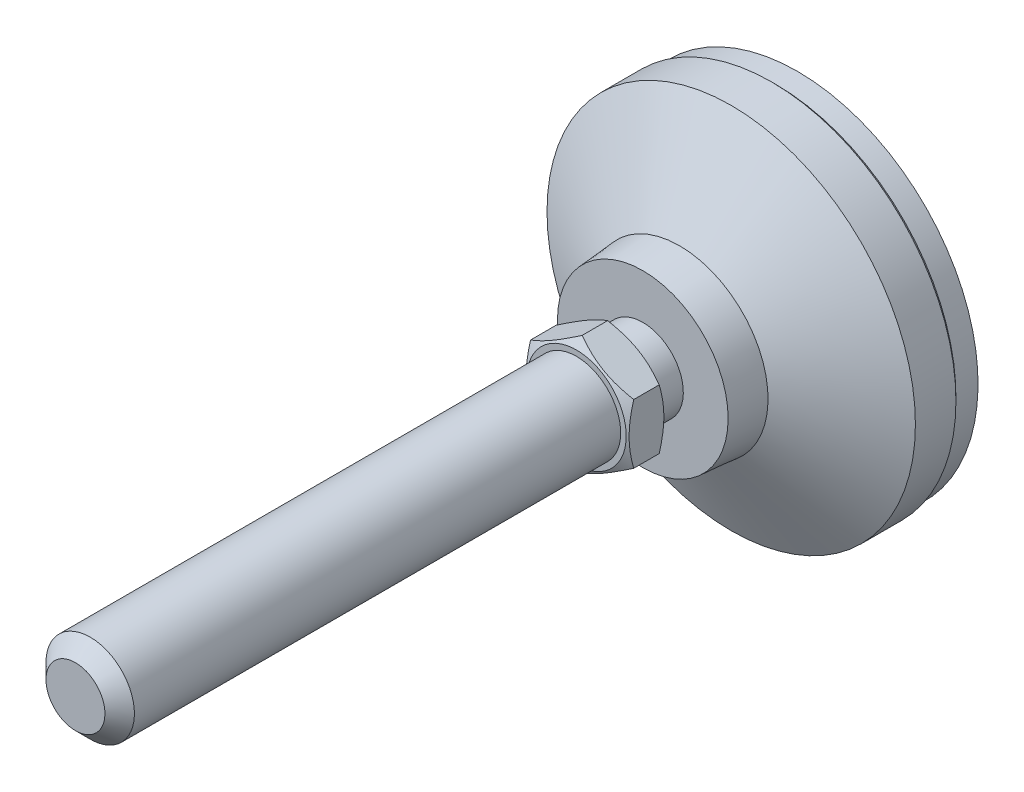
ISO-10303-21;
HEADER;
FILE_DESCRIPTION(('STEP AP214'),'2;1');
FILE_NAME('part.step','',(''),(''),'','','');
FILE_SCHEMA(('AUTOMOTIVE_DESIGN { 1 0 10303 214 1 1 1 1 }'));
ENDSEC;
DATA;
#1=APPLICATION_CONTEXT('core data for automotive mechanical design processes');
#2=APPLICATION_PROTOCOL_DEFINITION('international standard','automotive_design',2000,#1);
#3=PRODUCT_CONTEXT('',#1,'mechanical');
#4=PRODUCT('Part','Part','',(#3));
#5=PRODUCT_RELATED_PRODUCT_CATEGORY('part','',(#4));
#6=PRODUCT_DEFINITION_FORMATION('','',#4);
#7=PRODUCT_DEFINITION_CONTEXT('part definition',#1,'design');
#8=PRODUCT_DEFINITION('design','',#6,#7);
#9=PRODUCT_DEFINITION_SHAPE('','',#8);
#10=(LENGTH_UNIT() NAMED_UNIT(*) SI_UNIT(.MILLI.,.METRE.));
#11=(NAMED_UNIT(*) PLANE_ANGLE_UNIT() SI_UNIT($,.RADIAN.));
#12=(NAMED_UNIT(*) SI_UNIT($,.STERADIAN.) SOLID_ANGLE_UNIT());
#13=UNCERTAINTY_MEASURE_WITH_UNIT(LENGTH_MEASURE(1.E-05),#10,'distance_accuracy_value','');
#14=(GEOMETRIC_REPRESENTATION_CONTEXT(3) GLOBAL_UNCERTAINTY_ASSIGNED_CONTEXT((#13)) GLOBAL_UNIT_ASSIGNED_CONTEXT((#10,
#11,#12)) REPRESENTATION_CONTEXT('',''));
#15=CARTESIAN_POINT('',(0.,0.,0.));
#16=DIRECTION('',(0.,0.,1.));
#17=DIRECTION('',(1.,0.,0.));
#18=AXIS2_PLACEMENT_3D('',#15,#16,#17);
#19=CARTESIAN_POINT('',(0.,0.,1.99999999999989));
#20=DIRECTION('',(0.,0.,-1.));
#21=DIRECTION('',(0.,1.,0.));
#22=AXIS2_PLACEMENT_3D('',#19,#20,#21);
#23=CYLINDRICAL_SURFACE('',#22,5.5);
#24=CARTESIAN_POINT('',(0.,0.,24.9999999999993));
#25=DIRECTION('',(0.,0.,-1.));
#26=DIRECTION('',(0.,1.,0.));
#27=AXIS2_PLACEMENT_3D('',#24,#25,#26);
#28=CIRCLE('',#27,5.5);
#29=CARTESIAN_POINT('',(0.,5.5,24.9999999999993));
#30=VERTEX_POINT('',#29);
#31=EDGE_CURVE('E100',#30,#30,#28,.T.);
#32=ORIENTED_EDGE('',*,*,#31,.T.);
#33=EDGE_LOOP('',(#32));
#34=FACE_BOUND('',#33,.T.);
#35=CARTESIAN_POINT('',(0.,0.,21.));
#36=DIRECTION('',(0.,0.,-1.));
#37=DIRECTION('',(0.,1.,0.));
#38=AXIS2_PLACEMENT_3D('',#35,#36,#37);
#39=CIRCLE('',#38,5.5);
#40=CARTESIAN_POINT('',(0.,5.5,21.));
#41=VERTEX_POINT('',#40);
#42=EDGE_CURVE('E93',#41,#41,#39,.T.);
#43=ORIENTED_EDGE('',*,*,#42,.F.);
#44=EDGE_LOOP('',(#43));
#45=FACE_BOUND('',#44,.T.);
#46=ADVANCED_FACE('F14',(#34,#45),#23,.T.);
#47=CARTESIAN_POINT('',(-5.5,0.,24.9999999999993));
#48=DIRECTION('',(0.,0.,1.));
#49=DIRECTION('',(0.,-1.,0.));
#50=AXIS2_PLACEMENT_3D('',#47,#48,#49);
#51=PLANE('',#50);
#52=CARTESIAN_POINT('',(0.,0.,24.9999999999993));
#53=DIRECTION('',(0.,0.,1.));
#54=DIRECTION('',(0.,-1.,0.));
#55=AXIS2_PLACEMENT_3D('',#52,#53,#54);
#56=CIRCLE('',#55,6.75);
#57=CARTESIAN_POINT('',(0.,-6.75,24.9999999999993));
#58=VERTEX_POINT('',#57);
#59=EDGE_CURVE('E443',#58,#58,#56,.T.);
#60=ORIENTED_EDGE('',*,*,#59,.F.);
#61=EDGE_LOOP('',(#60));
#62=FACE_BOUND('',#61,.T.);
#63=ORIENTED_EDGE('',*,*,#31,.F.);
#64=EDGE_LOOP('',(#63));
#65=FACE_BOUND('',#64,.T.);
#66=ADVANCED_FACE('F137',(#62,#65),#51,.F.);
#67=CARTESIAN_POINT('',(0.,-5.5,21.));
#68=DIRECTION('',(0.,0.,1.));
#69=DIRECTION('',(0.,-1.,0.));
#70=AXIS2_PLACEMENT_3D('',#67,#68,#69);
#71=PLANE('',#70);
#72=ORIENTED_EDGE('',*,*,#42,.T.);
#73=EDGE_LOOP('',(#72));
#74=FACE_BOUND('',#73,.T.);
#75=CARTESIAN_POINT('',(0.,0.,21.));
#76=DIRECTION('',(0.,0.,1.));
#77=DIRECTION('',(0.,-1.,0.));
#78=AXIS2_PLACEMENT_3D('',#75,#76,#77);
#79=CIRCLE('',#78,11.5833333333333);
#80=CARTESIAN_POINT('',(0.,-11.5833333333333,21.));
#81=VERTEX_POINT('',#80);
#82=EDGE_CURVE('E88',#81,#81,#79,.T.);
#83=ORIENTED_EDGE('',*,*,#82,.T.);
#84=EDGE_LOOP('',(#83));
#85=FACE_BOUND('',#84,.T.);
#86=ADVANCED_FACE('F144',(#74,#85),#71,.T.);
#87=CARTESIAN_POINT('',(0.,0.,1.99999999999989));
#88=DIRECTION('',(0.,0.,-1.));
#89=DIRECTION('',(0.,1.,0.));
#90=AXIS2_PLACEMENT_3D('',#87,#88,#89);
#91=CYLINDRICAL_SURFACE('',#90,25.);
#92=CARTESIAN_POINT('',(0.,0.,3.5));
#93=DIRECTION('',(0.,0.,-1.));
#94=DIRECTION('',(0.,1.,0.));
#95=AXIS2_PLACEMENT_3D('',#92,#93,#94);
#96=CIRCLE('',#95,25.);
#97=CARTESIAN_POINT('',(0.,25.,3.5));
#98=VERTEX_POINT('',#97);
#99=EDGE_CURVE('E28',#98,#98,#96,.F.);
#100=ORIENTED_EDGE('',*,*,#99,.T.);
#101=EDGE_LOOP('',(#100));
#102=FACE_BOUND('',#101,.T.);
#103=CARTESIAN_POINT('',(0.,0.,9.));
#104=DIRECTION('',(0.,0.,-1.));
#105=DIRECTION('',(0.,1.,0.));
#106=AXIS2_PLACEMENT_3D('',#103,#104,#105);
#107=CIRCLE('',#106,25.);
#108=CARTESIAN_POINT('',(0.,25.,9.));
#109=VERTEX_POINT('',#108);
#110=EDGE_CURVE('E106',#109,#109,#107,.T.);
#111=ORIENTED_EDGE('',*,*,#110,.T.);
#112=EDGE_LOOP('',(#111));
#113=FACE_BOUND('',#112,.T.);
#114=ADVANCED_FACE('F114',(#102,#113),#91,.T.);
#115=CARTESIAN_POINT('',(0.,0.,16.));
#116=DIRECTION('',(0.,0.,-1.));
#117=DIRECTION('',(0.,1.,0.));
#118=AXIS2_PLACEMENT_3D('',#115,#116,#117);
#119=CONICAL_SURFACE('',#118,11.9999999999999,1.07685495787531);
#120=ORIENTED_EDGE('',*,*,#110,.F.);
#121=EDGE_LOOP('',(#120));
#122=FACE_BOUND('',#121,.T.);
#123=CARTESIAN_POINT('',(0.,0.,16.));
#124=DIRECTION('',(0.,0.,-1.));
#125=DIRECTION('',(0.,1.,0.));
#126=AXIS2_PLACEMENT_3D('',#123,#124,#125);
#127=CIRCLE('',#126,11.9999999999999);
#128=CARTESIAN_POINT('',(0.,11.9999999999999,16.));
#129=VERTEX_POINT('',#128);
#130=EDGE_CURVE('E103',#129,#129,#127,.T.);
#131=ORIENTED_EDGE('',*,*,#130,.T.);
#132=EDGE_LOOP('',(#131));
#133=FACE_BOUND('',#132,.T.);
#134=ADVANCED_FACE('F152',(#122,#133),#119,.T.);
#135=CARTESIAN_POINT('',(0.,0.,22.));
#136=DIRECTION('',(0.,0.,-1.));
#137=DIRECTION('',(0.,1.,0.));
#138=AXIS2_PLACEMENT_3D('',#135,#136,#137);
#139=CONICAL_SURFACE('',#138,11.5,0.0831412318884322);
#140=ORIENTED_EDGE('',*,*,#130,.F.);
#141=EDGE_LOOP('',(#140));
#142=FACE_BOUND('',#141,.T.);
#143=ORIENTED_EDGE('',*,*,#82,.F.);
#144=EDGE_LOOP('',(#143));
#145=FACE_BOUND('',#144,.T.);
#146=ADVANCED_FACE('F120',(#142,#145),#139,.T.);
#147=CARTESIAN_POINT('',(0.,0.,3.));
#148=DIRECTION('',(0.,0.,1.));
#149=DIRECTION('',(0.,-1.,0.));
#150=AXIS2_PLACEMENT_3D('',#147,#148,#149);
#151=CONICAL_SURFACE('',#150,24.5,0.785398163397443);
#152=ORIENTED_EDGE('',*,*,#99,.F.);
#153=EDGE_LOOP('',(#152));
#154=FACE_BOUND('',#153,.T.);
#155=CARTESIAN_POINT('',(0.,0.,3.));
#156=DIRECTION('',(0.,0.,-1.));
#157=DIRECTION('',(0.,1.,0.));
#158=AXIS2_PLACEMENT_3D('',#155,#156,#157);
#159=CIRCLE('',#158,24.5);
#160=CARTESIAN_POINT('',(0.,24.5,3.));
#161=VERTEX_POINT('',#160);
#162=EDGE_CURVE('E108',#161,#161,#159,.T.);
#163=ORIENTED_EDGE('',*,*,#162,.F.);
#164=EDGE_LOOP('',(#163));
#165=FACE_BOUND('',#164,.T.);
#166=ADVANCED_FACE('F16',(#154,#165),#151,.T.);
#167=CARTESIAN_POINT('',(0.,0.,0.));
#168=DIRECTION('',(0.,0.,1.));
#169=DIRECTION('',(0.,-1.,0.));
#170=AXIS2_PLACEMENT_3D('',#167,#168,#169);
#171=CYLINDRICAL_SURFACE('',#170,24.5);
#172=CARTESIAN_POINT('',(0.,0.,0.));
#173=DIRECTION('',(0.,0.,-1.));
#174=DIRECTION('',(0.,1.,0.));
#175=AXIS2_PLACEMENT_3D('',#172,#173,#174);
#176=CIRCLE('',#175,24.5);
#177=CARTESIAN_POINT('',(0.,24.5,0.));
#178=VERTEX_POINT('',#177);
#179=EDGE_CURVE('E260',#178,#178,#176,.T.);
#180=ORIENTED_EDGE('',*,*,#179,.F.);
#181=EDGE_LOOP('',(#180));
#182=FACE_BOUND('',#181,.T.);
#183=ORIENTED_EDGE('',*,*,#162,.T.);
#184=EDGE_LOOP('',(#183));
#185=FACE_BOUND('',#184,.T.);
#186=ADVANCED_FACE('F119',(#182,#185),#171,.T.);
#187=CARTESIAN_POINT('',(0.,0.,0.));
#188=DIRECTION('',(0.,0.,-1.));
#189=DIRECTION('',(0.,1.,0.));
#190=AXIS2_PLACEMENT_3D('',#187,#188,#189);
#191=PLANE('',#190);
#192=ORIENTED_EDGE('',*,*,#179,.T.);
#193=EDGE_LOOP('',(#192));
#194=FACE_BOUND('',#193,.T.);
#195=ADVANCED_FACE('F124',(#194),#191,.T.);
#196=CARTESIAN_POINT('',(0.,0.,24.9999999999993));
#197=DIRECTION('',(0.,0.,1.));
#198=DIRECTION('',(0.,-1.,0.));
#199=AXIS2_PLACEMENT_3D('',#196,#197,#198);
#200=CONICAL_SURFACE('',#199,6.75,1.0471975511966);
#201=CARTESIAN_POINT('',(0.000200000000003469,-8.0830192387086,25.7696190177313));
#202=CARTESIAN_POINT('',(-0.15366790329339,-7.99418356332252,25.7183374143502));
#203=CARTESIAN_POINT('',(-0.308109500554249,-7.90501666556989,25.6693831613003));
#204=CARTESIAN_POINT('',(-0.618246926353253,-7.72595873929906,25.5767703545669));
#205=CARTESIAN_POINT('',(-0.773943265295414,-7.63606741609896,25.5331140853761));
#206=CARTESIAN_POINT('',(-1.24352516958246,-7.36495417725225,25.4109491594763));
#207=CARTESIAN_POINT('',(-1.5592643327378,-7.18266208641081,25.3414631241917));
#208=CARTESIAN_POINT('',(-2.03176224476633,-6.90986528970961,25.2599825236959));
#209=CARTESIAN_POINT('',(-2.18710922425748,-6.82017566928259,25.2367710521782));
#210=CARTESIAN_POINT('',(-2.49850511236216,-6.64039116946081,25.1978487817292));
#211=CARTESIAN_POINT('',(-2.65455395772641,-6.55029632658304,25.1821373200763));
#212=CARTESIAN_POINT('',(-2.96692267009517,-6.36995016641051,25.1586154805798));
#213=CARTESIAN_POINT('',(-3.12324202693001,-6.27969914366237,25.1507961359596));
#214=CARTESIAN_POINT('',(-3.43601650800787,-6.09911871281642,25.1432178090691));
#215=CARTESIAN_POINT('',(-3.59247162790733,-6.00878930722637,25.1434585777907));
#216=CARTESIAN_POINT('',(-4.02110687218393,-5.76131663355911,25.1551972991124));
#217=CARTESIAN_POINT('',(-4.2931466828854,-5.60425437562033,25.1749033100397));
#218=CARTESIAN_POINT('',(-4.83541944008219,-5.29117305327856,25.2373910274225));
#219=CARTESIAN_POINT('',(-5.10565047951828,-5.13515508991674,25.2801940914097));
#220=CARTESIAN_POINT('',(-5.64901454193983,-4.82144370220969,25.3871892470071));
#221=CARTESIAN_POINT('',(-5.92207900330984,-4.6637898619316,25.4518346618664));
#222=CARTESIAN_POINT('',(-6.46413578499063,-4.35083323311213,25.5985536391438));
#223=CARTESIAN_POINT('',(-6.73313504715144,-4.19552643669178,25.6805927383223));
#224=CARTESIAN_POINT('',(-7.0002,-4.04133641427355,25.7696190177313));
#225=B_SPLINE_CURVE_WITH_KNOTS('',3,(#201,#202,#203,#204,#205,#206,#207,#208,#209,#210,#211,
#212,#213,#214,#215,#216,#217,#218,#219,#220,#221,#222,#223,#224),.UNSPECIFIED.,.F.,.F.,(4,2,2,
2,2,2,2,2,2,2,2,4),(0.,0.554727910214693,1.10969417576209,2.2219327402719,2.76443041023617,
3.30688013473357,3.8487128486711,4.39052882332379,5.33376515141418,6.27787517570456,
7.2429241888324,8.20607866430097),.UNSPECIFIED.);
#226=CARTESIAN_POINT('',(0.,-8.08290376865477,25.7695523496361));
#227=VERTEX_POINT('',#226);
#228=CARTESIAN_POINT('',(-7.,-4.04145188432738,25.769552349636));
#229=VERTEX_POINT('',#228);
#230=EDGE_CURVE('E73',#227,#229,#225,.T.);
#231=ORIENTED_EDGE('',*,*,#230,.T.);
#232=CARTESIAN_POINT('',(-7.,10.8216706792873,28.5439554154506));
#233=CARTESIAN_POINT('',(-7.,10.5162184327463,28.3959213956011));
#234=CARTESIAN_POINT('',(-7.,10.210061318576,28.2493167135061));
#235=CARTESIAN_POINT('',(-7.,9.59596236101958,27.9597706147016));
#236=CARTESIAN_POINT('',(-7.,9.288020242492,27.8168297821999));
#237=CARTESIAN_POINT('',(-7.,8.66837323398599,27.5346895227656));
#238=CARTESIAN_POINT('',(-7.,8.35665696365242,27.3955150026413));
#239=CARTESIAN_POINT('',(-7.,7.73073318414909,27.1229073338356));
#240=CARTESIAN_POINT('',(-7.,7.41652579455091,26.9894739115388));
#241=CARTESIAN_POINT('',(-7.,6.77511259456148,26.7257508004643));
#242=CARTESIAN_POINT('',(-7.,6.44781027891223,26.5956945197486));
#243=CARTESIAN_POINT('',(-7.,5.78936463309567,26.3455080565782));
#244=CARTESIAN_POINT('',(-7.,5.45822087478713,26.2253789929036));
#245=CARTESIAN_POINT('',(-7.,4.79219242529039,25.9982260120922));
#246=CARTESIAN_POINT('',(-7.,4.4573169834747,25.8911752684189));
#247=CARTESIAN_POINT('',(-7.,3.78277488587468,25.693635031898));
#248=CARTESIAN_POINT('',(-7.,3.44310978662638,25.6031402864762));
#249=CARTESIAN_POINT('',(-7.,2.76061635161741,25.4435626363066));
#250=CARTESIAN_POINT('',(-7.,2.4178155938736,25.3743649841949));
#251=CARTESIAN_POINT('',(-7.,1.90052032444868,25.2895544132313));
#252=CARTESIAN_POINT('',(-7.,1.72755991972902,25.2644473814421));
#253=CARTESIAN_POINT('',(-7.,1.38079107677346,25.2210551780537));
#254=CARTESIAN_POINT('',(-7.,1.20698272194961,25.2027693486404));
#255=CARTESIAN_POINT('',(-7.,0.861006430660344,25.1736114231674));
#256=CARTESIAN_POINT('',(-7.,0.688846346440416,25.1626465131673));
#257=CARTESIAN_POINT('',(-7.,0.344216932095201,25.1480044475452));
#258=CARTESIAN_POINT('',(-7.,0.171747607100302,25.1443271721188));
#259=CARTESIAN_POINT('',(-7.,-0.173192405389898,25.1443480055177));
#260=CARTESIAN_POINT('',(-7.,-0.345663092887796,25.1480461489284));
#261=CARTESIAN_POINT('',(-7.,-0.690296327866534,25.1627280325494));
#262=CARTESIAN_POINT('',(-7.,-0.862458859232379,25.1737121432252));
#263=CARTESIAN_POINT('',(-7.,-1.27725818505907,25.2087228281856));
#264=CARTESIAN_POINT('',(-7.,-1.51960447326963,25.2362640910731));
#265=CARTESIAN_POINT('',(-7.,-2.00246443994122,25.3042732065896));
#266=CARTESIAN_POINT('',(-7.,-2.24297786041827,25.3447428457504));
#267=CARTESIAN_POINT('',(-7.,-2.96151283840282,25.4833954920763));
#268=CARTESIAN_POINT('',(-7.,-3.43625407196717,25.5987959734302));
#269=CARTESIAN_POINT('',(-7.,-4.14607556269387,25.7984851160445));
#270=CARTESIAN_POINT('',(-7.,-4.38484828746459,25.870399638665));
#271=CARTESIAN_POINT('',(-7.,-4.86007386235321,26.0215919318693));
#272=CARTESIAN_POINT('',(-7.,-5.09652669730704,26.1008697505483));
#273=CARTESIAN_POINT('',(-7.,-5.56718894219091,26.2655254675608));
#274=CARTESIAN_POINT('',(-7.,-5.8013990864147,26.3509012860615));
#275=CARTESIAN_POINT('',(-7.,-6.26788600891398,26.5267590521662));
#276=CARTESIAN_POINT('',(-7.,-6.50016280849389,26.6172409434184));
#277=CARTESIAN_POINT('',(-7.,-7.04284823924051,26.8344156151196));
#278=CARTESIAN_POINT('',(-7.,-7.35256592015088,26.9628316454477));
#279=CARTESIAN_POINT('',(-7.,-7.96941541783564,27.2257484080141));
#280=CARTESIAN_POINT('',(-7.,-8.27654708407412,27.3602494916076));
#281=CARTESIAN_POINT('',(-7.,-8.8886930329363,27.6341296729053));
#282=CARTESIAN_POINT('',(-7.,-9.19370689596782,27.77350970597));
#283=CARTESIAN_POINT('',(-7.,-9.80191861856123,28.0561841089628));
#284=CARTESIAN_POINT('',(-7.,-10.1051164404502,28.1994785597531));
#285=CARTESIAN_POINT('',(-7.,-10.7102959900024,28.4894024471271));
#286=CARTESIAN_POINT('',(-7.,-11.0122761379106,28.6360351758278));
#287=CARTESIAN_POINT('',(-7.,-11.6149457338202,28.9319318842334));
#288=CARTESIAN_POINT('',(-7.,-11.9156351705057,29.0811958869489));
#289=CARTESIAN_POINT('',(-7.,-12.8159957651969,29.5322046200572));
#290=CARTESIAN_POINT('',(-7.,-13.4140366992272,29.8372035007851));
#291=CARTESIAN_POINT('',(-7.,-14.5578223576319,30.4279546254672));
#292=CARTESIAN_POINT('',(-7.,-15.1038179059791,30.7132233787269));
#293=CARTESIAN_POINT('',(-7.,-16.1937760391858,31.2876600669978));
#294=CARTESIAN_POINT('',(-7.,-16.7377385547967,31.5768281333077));
#295=CARTESIAN_POINT('',(-7.,-17.8227609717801,32.1574369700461));
#296=CARTESIAN_POINT('',(-7.,-18.3638247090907,32.4488705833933));
#297=CARTESIAN_POINT('',(-7.,-19.4446492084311,33.0340762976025));
#298=CARTESIAN_POINT('',(-7.,-19.9844100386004,33.3278482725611));
#299=CARTESIAN_POINT('',(-7.,-20.5236897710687,33.6224948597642));
#300=B_SPLINE_CURVE_WITH_KNOTS('',3,(#232,#233,#234,#235,#236,#237,#238,#239,#240,#241,#242,
#243,#244,#245,#246,#247,#248,#249,#250,#251,#252,#253,#254,#255,#256,#257,#258,#259,#260,#261,
#262,#263,#264,#265,#266,#267,#268,#269,#270,#271,#272,#273,#274,#275,#276,#277,#278,#279,#280,
#281,#282,#283,#284,#285,#286,#287,#288,#289,#290,#291,#292,#293,#294,#295,#296,#297,#298,#299),
.UNSPECIFIED.,.F.,.F.,(4,2,2,2,2,2,2,2,2,2,2,2,2,2,2,2,2,2,2,2,2,2,2,2,2,2,2,2,2,2,2,2,2,4),(0.,
1.0183132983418,2.03678797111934,3.06086523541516,4.0848936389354,5.14135423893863,
6.19793373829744,7.25230821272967,8.30634759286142,9.35460422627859,9.87881040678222,
10.4029660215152,10.9203434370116,11.4377123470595,11.9550836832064,12.4724813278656,
13.203786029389,13.9351918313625,15.3988285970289,16.1468698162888,16.8949159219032,
17.6427081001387,18.3904920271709,19.3962585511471,20.4020832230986,21.4081017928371,
22.4141411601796,23.4212197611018,24.4283071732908,26.4422238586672,28.2902883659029,
30.1384152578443,31.982087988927,33.8256621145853),.UNSPECIFIED.);
#301=CARTESIAN_POINT('',(-7.,4.04145188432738,25.769552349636));
#302=VERTEX_POINT('',#301);
#303=EDGE_CURVE('E81',#229,#302,#300,.F.);
#304=ORIENTED_EDGE('',*,*,#303,.T.);
#305=CARTESIAN_POINT('',(-7.0002,4.04133641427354,25.7696190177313));
#306=CARTESIAN_POINT('',(-6.84633209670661,4.13017208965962,25.7183374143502));
#307=CARTESIAN_POINT('',(-6.69189049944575,4.21933898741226,25.6693831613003));
#308=CARTESIAN_POINT('',(-6.38175307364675,4.39839691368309,25.5767703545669));
#309=CARTESIAN_POINT('',(-6.22605673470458,4.48828823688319,25.5331140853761));
#310=CARTESIAN_POINT('',(-5.75647483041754,4.75940147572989,25.4109491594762));
#311=CARTESIAN_POINT('',(-5.4407356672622,4.94169356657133,25.3414631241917));
#312=CARTESIAN_POINT('',(-4.96823775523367,5.21449036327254,25.2599825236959));
#313=CARTESIAN_POINT('',(-4.81289077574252,5.30417998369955,25.2367710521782));
#314=CARTESIAN_POINT('',(-4.50149488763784,5.48396448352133,25.1978487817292));
#315=CARTESIAN_POINT('',(-4.34544604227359,5.57405932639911,25.1821373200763));
#316=CARTESIAN_POINT('',(-4.03307732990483,5.75440548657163,25.1586154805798));
#317=CARTESIAN_POINT('',(-3.87675797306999,5.84465650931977,25.1507961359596));
#318=CARTESIAN_POINT('',(-3.56398349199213,6.02523694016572,25.1432178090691));
#319=CARTESIAN_POINT('',(-3.40752837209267,6.11556634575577,25.1434585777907));
#320=CARTESIAN_POINT('',(-2.97889312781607,6.36303901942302,25.1551972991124));
#321=CARTESIAN_POINT('',(-2.7068533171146,6.52010127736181,25.1749033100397));
#322=CARTESIAN_POINT('',(-2.16458055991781,6.83318259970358,25.2373910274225));
#323=CARTESIAN_POINT('',(-1.89434952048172,6.9892005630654,25.2801940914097));
#324=CARTESIAN_POINT('',(-1.35098545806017,7.30291195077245,25.3871892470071));
#325=CARTESIAN_POINT('',(-1.07792099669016,7.46056579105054,25.4518346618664));
#326=CARTESIAN_POINT('',(-0.535864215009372,7.77352241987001,25.5985536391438));
#327=CARTESIAN_POINT('',(-0.266864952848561,7.92882921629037,25.6805927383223));
#328=CARTESIAN_POINT('',(0.000199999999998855,8.0830192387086,25.7696190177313));
#329=B_SPLINE_CURVE_WITH_KNOTS('',3,(#305,#306,#307,#308,#309,#310,#311,#312,#313,#314,#315,
#316,#317,#318,#319,#320,#321,#322,#323,#324,#325,#326,#327,#328),.UNSPECIFIED.,.F.,.F.,(4,2,2,
2,2,2,2,2,2,2,2,4),(0.,0.554727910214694,1.10969417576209,2.2219327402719,2.76443041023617,
3.30688013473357,3.84871284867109,4.39052882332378,5.33376515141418,6.27787517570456,
7.2429241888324,8.20607866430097),.UNSPECIFIED.);
#330=CARTESIAN_POINT('',(0.,8.08290376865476,25.769552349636));
#331=VERTEX_POINT('',#330);
#332=EDGE_CURVE('E195',#302,#331,#329,.T.);
#333=ORIENTED_EDGE('',*,*,#332,.T.);
#334=CARTESIAN_POINT('',(-0.000200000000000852,8.0830192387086,25.7696190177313));
#335=CARTESIAN_POINT('',(0.153667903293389,7.99418356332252,25.7183374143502));
#336=CARTESIAN_POINT('',(0.308109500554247,7.90501666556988,25.6693831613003));
#337=CARTESIAN_POINT('',(0.618246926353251,7.72595873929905,25.5767703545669));
#338=CARTESIAN_POINT('',(0.773943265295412,7.63606741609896,25.5331140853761));
#339=CARTESIAN_POINT('',(1.24352516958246,7.36495417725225,25.4109491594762));
#340=CARTESIAN_POINT('',(1.5592643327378,7.18266208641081,25.3414631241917));
#341=CARTESIAN_POINT('',(2.03176224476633,6.9098652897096,25.2599825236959));
#342=CARTESIAN_POINT('',(2.18710922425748,6.82017566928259,25.2367710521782));
#343=CARTESIAN_POINT('',(2.49850511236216,6.64039116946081,25.1978487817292));
#344=CARTESIAN_POINT('',(2.6545539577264,6.55029632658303,25.1821373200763));
#345=CARTESIAN_POINT('',(2.96692267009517,6.36995016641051,25.1586154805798));
#346=CARTESIAN_POINT('',(3.12324202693,6.27969914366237,25.1507961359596));
#347=CARTESIAN_POINT('',(3.43601650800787,6.09911871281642,25.1432178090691));
#348=CARTESIAN_POINT('',(3.59247162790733,6.00878930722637,25.1434585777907));
#349=CARTESIAN_POINT('',(4.02110687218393,5.76131663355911,25.1551972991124));
#350=CARTESIAN_POINT('',(4.29314668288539,5.60425437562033,25.1749033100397));
#351=CARTESIAN_POINT('',(4.83541944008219,5.29117305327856,25.2373910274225));
#352=CARTESIAN_POINT('',(5.10565047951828,5.13515508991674,25.2801940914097));
#353=CARTESIAN_POINT('',(5.64901454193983,4.82144370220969,25.3871892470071));
#354=CARTESIAN_POINT('',(5.92207900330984,4.66378986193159,25.4518346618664));
#355=CARTESIAN_POINT('',(6.46413578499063,4.35083323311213,25.5985536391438));
#356=CARTESIAN_POINT('',(6.73313504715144,4.19552643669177,25.6805927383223));
#357=CARTESIAN_POINT('',(7.0002,4.04133641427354,25.7696190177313));
#358=B_SPLINE_CURVE_WITH_KNOTS('',3,(#334,#335,#336,#337,#338,#339,#340,#341,#342,#343,#344,
#345,#346,#347,#348,#349,#350,#351,#352,#353,#354,#355,#356,#357),.UNSPECIFIED.,.F.,.F.,(4,2,2,
2,2,2,2,2,2,2,2,4),(0.,0.554727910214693,1.10969417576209,2.2219327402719,2.76443041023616,
3.30688013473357,3.84871284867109,4.39052882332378,5.33376515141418,6.27787517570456,
7.2429241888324,8.20607866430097),.UNSPECIFIED.);
#359=CARTESIAN_POINT('',(7.,4.04145188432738,25.769552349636));
#360=VERTEX_POINT('',#359);
#361=EDGE_CURVE('E223',#331,#360,#358,.T.);
#362=ORIENTED_EDGE('',*,*,#361,.T.);
#363=CARTESIAN_POINT('',(7.,10.8216706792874,28.5439554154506));
#364=CARTESIAN_POINT('',(7.,10.5162184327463,28.3959213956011));
#365=CARTESIAN_POINT('',(7.,10.210061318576,28.2493167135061));
#366=CARTESIAN_POINT('',(7.,9.5959623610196,27.9597706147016));
#367=CARTESIAN_POINT('',(7.,9.28802024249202,27.8168297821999));
#368=CARTESIAN_POINT('',(7.,8.668373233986,27.5346895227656));
#369=CARTESIAN_POINT('',(7.,8.35665696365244,27.3955150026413));
#370=CARTESIAN_POINT('',(7.,7.7307331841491,27.1229073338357));
#371=CARTESIAN_POINT('',(7.,7.41652579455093,26.9894739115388));
#372=CARTESIAN_POINT('',(7.,6.7751125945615,26.7257508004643));
#373=CARTESIAN_POINT('',(7.,6.44781027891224,26.5956945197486));
#374=CARTESIAN_POINT('',(7.,5.78936463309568,26.3455080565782));
#375=CARTESIAN_POINT('',(7.,5.45822087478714,26.2253789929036));
#376=CARTESIAN_POINT('',(7.,4.7921924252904,25.9982260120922));
#377=CARTESIAN_POINT('',(7.,4.45731698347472,25.891175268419));
#378=CARTESIAN_POINT('',(7.,3.78277488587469,25.693635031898));
#379=CARTESIAN_POINT('',(7.,3.44310978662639,25.6031402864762));
#380=CARTESIAN_POINT('',(7.,2.76061635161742,25.4435626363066));
#381=CARTESIAN_POINT('',(7.,2.41781559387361,25.3743649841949));
#382=CARTESIAN_POINT('',(7.,1.90052032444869,25.2895544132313));
#383=CARTESIAN_POINT('',(7.,1.72755991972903,25.2644473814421));
#384=CARTESIAN_POINT('',(7.,1.38079107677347,25.2210551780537));
#385=CARTESIAN_POINT('',(7.,1.20698272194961,25.2027693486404));
#386=CARTESIAN_POINT('',(7.,0.861006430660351,25.1736114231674));
#387=CARTESIAN_POINT('',(7.,0.688846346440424,25.1626465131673));
#388=CARTESIAN_POINT('',(7.,0.344216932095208,25.1480044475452));
#389=CARTESIAN_POINT('',(7.,0.171747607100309,25.1443271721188));
#390=CARTESIAN_POINT('',(7.,-0.173192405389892,25.1443480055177));
#391=CARTESIAN_POINT('',(7.,-0.34566309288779,25.1480461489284));
#392=CARTESIAN_POINT('',(7.,-0.690296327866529,25.1627280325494));
#393=CARTESIAN_POINT('',(7.,-0.862458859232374,25.1737121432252));
#394=CARTESIAN_POINT('',(7.,-1.27725818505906,25.2087228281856));
#395=CARTESIAN_POINT('',(7.,-1.51960447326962,25.2362640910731));
#396=CARTESIAN_POINT('',(7.,-2.00246443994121,25.3042732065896));
#397=CARTESIAN_POINT('',(7.,-2.24297786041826,25.3447428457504));
#398=CARTESIAN_POINT('',(7.,-2.96151283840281,25.4833954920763));
#399=CARTESIAN_POINT('',(7.,-3.43625407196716,25.5987959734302));
#400=CARTESIAN_POINT('',(7.,-4.14607556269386,25.7984851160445));
#401=CARTESIAN_POINT('',(7.,-4.38484828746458,25.8703996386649));
#402=CARTESIAN_POINT('',(7.,-4.8600738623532,26.0215919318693));
#403=CARTESIAN_POINT('',(7.,-5.09652669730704,26.1008697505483));
#404=CARTESIAN_POINT('',(7.,-5.5671889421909,26.2655254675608));
#405=CARTESIAN_POINT('',(7.,-5.80139908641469,26.3509012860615));
#406=CARTESIAN_POINT('',(7.,-6.26788600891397,26.5267590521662));
#407=CARTESIAN_POINT('',(7.,-6.50016280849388,26.6172409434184));
#408=CARTESIAN_POINT('',(7.,-7.0428482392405,26.8344156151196));
#409=CARTESIAN_POINT('',(7.,-7.35256592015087,26.9628316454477));
#410=CARTESIAN_POINT('',(7.,-7.96941541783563,27.2257484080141));
#411=CARTESIAN_POINT('',(7.,-8.27654708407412,27.3602494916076));
#412=CARTESIAN_POINT('',(7.,-8.8886930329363,27.6341296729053));
#413=CARTESIAN_POINT('',(7.,-9.19370689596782,27.77350970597));
#414=CARTESIAN_POINT('',(7.,-9.80191861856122,28.0561841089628));
#415=CARTESIAN_POINT('',(7.,-10.1051164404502,28.1994785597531));
#416=CARTESIAN_POINT('',(7.,-10.7102959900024,28.4894024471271));
#417=CARTESIAN_POINT('',(7.,-11.0122761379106,28.6360351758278));
#418=CARTESIAN_POINT('',(7.,-11.6149457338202,28.9319318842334));
#419=CARTESIAN_POINT('',(7.,-11.9156351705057,29.0811958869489));
#420=CARTESIAN_POINT('',(7.,-12.8159957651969,29.5322046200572));
#421=CARTESIAN_POINT('',(7.,-13.4140366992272,29.8372035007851));
#422=CARTESIAN_POINT('',(7.,-14.5578223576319,30.4279546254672));
#423=CARTESIAN_POINT('',(7.,-15.1038179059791,30.7132233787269));
#424=CARTESIAN_POINT('',(7.,-16.1937760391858,31.2876600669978));
#425=CARTESIAN_POINT('',(7.,-16.7377385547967,31.5768281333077));
#426=CARTESIAN_POINT('',(7.,-17.8227609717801,32.1574369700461));
#427=CARTESIAN_POINT('',(7.,-18.3638247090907,32.4488705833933));
#428=CARTESIAN_POINT('',(7.,-19.4446492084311,33.0340762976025));
#429=CARTESIAN_POINT('',(7.,-19.9844100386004,33.3278482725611));
#430=CARTESIAN_POINT('',(7.,-20.5236897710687,33.6224948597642));
#431=B_SPLINE_CURVE_WITH_KNOTS('',3,(#363,#364,#365,#366,#367,#368,#369,#370,#371,#372,#373,
#374,#375,#376,#377,#378,#379,#380,#381,#382,#383,#384,#385,#386,#387,#388,#389,#390,#391,#392,
#393,#394,#395,#396,#397,#398,#399,#400,#401,#402,#403,#404,#405,#406,#407,#408,#409,#410,#411,
#412,#413,#414,#415,#416,#417,#418,#419,#420,#421,#422,#423,#424,#425,#426,#427,#428,#429,#430),
.UNSPECIFIED.,.F.,.F.,(4,2,2,2,2,2,2,2,2,2,2,2,2,2,2,2,2,2,2,2,2,2,2,2,2,2,2,2,2,2,2,2,2,4),(0.,
1.01831329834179,2.03678797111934,3.06086523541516,4.0848936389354,5.14135423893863,
6.19793373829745,7.25230821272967,8.30634759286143,9.35460422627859,9.87881040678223,
10.4029660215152,10.9203434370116,11.4377123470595,11.9550836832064,12.4724813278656,
13.203786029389,13.9351918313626,15.3988285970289,16.1468698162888,16.8949159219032,
17.6427081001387,18.3904920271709,19.3962585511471,20.4020832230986,21.4081017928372,
22.4141411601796,23.4212197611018,24.4283071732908,26.4422238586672,28.2902883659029,
30.1384152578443,31.982087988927,33.8256621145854),.UNSPECIFIED.);
#432=CARTESIAN_POINT('',(7.,-4.04145188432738,25.769552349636));
#433=VERTEX_POINT('',#432);
#434=EDGE_CURVE('E34',#360,#433,#431,.T.);
#435=ORIENTED_EDGE('',*,*,#434,.T.);
#436=CARTESIAN_POINT('',(7.0002,-4.04133641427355,25.7696190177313));
#437=CARTESIAN_POINT('',(6.84633209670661,-4.13017208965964,25.7183374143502));
#438=CARTESIAN_POINT('',(6.69189049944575,-4.21933898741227,25.6693831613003));
#439=CARTESIAN_POINT('',(6.38175307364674,-4.3983969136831,25.5767703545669));
#440=CARTESIAN_POINT('',(6.22605673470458,-4.4882882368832,25.5331140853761));
#441=CARTESIAN_POINT('',(5.75647483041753,-4.7594014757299,25.4109491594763));
#442=CARTESIAN_POINT('',(5.4407356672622,-4.94169356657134,25.3414631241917));
#443=CARTESIAN_POINT('',(4.96823775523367,-5.21449036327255,25.2599825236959));
#444=CARTESIAN_POINT('',(4.81289077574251,-5.30417998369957,25.2367710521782));
#445=CARTESIAN_POINT('',(4.50149488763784,-5.48396448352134,25.1978487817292));
#446=CARTESIAN_POINT('',(4.34544604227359,-5.57405932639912,25.1821373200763));
#447=CARTESIAN_POINT('',(4.03307732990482,-5.75440548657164,25.1586154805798));
#448=CARTESIAN_POINT('',(3.87675797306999,-5.84465650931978,25.1507961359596));
#449=CARTESIAN_POINT('',(3.56398349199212,-6.02523694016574,25.1432178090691));
#450=CARTESIAN_POINT('',(3.40752837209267,-6.11556634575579,25.1434585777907));
#451=CARTESIAN_POINT('',(2.97889312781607,-6.36303901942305,25.1551972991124));
#452=CARTESIAN_POINT('',(2.7068533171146,-6.52010127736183,25.1749033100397));
#453=CARTESIAN_POINT('',(2.1645805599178,-6.83318259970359,25.2373910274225));
#454=CARTESIAN_POINT('',(1.89434952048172,-6.98920056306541,25.2801940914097));
#455=CARTESIAN_POINT('',(1.35098545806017,-7.30291195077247,25.3871892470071));
#456=CARTESIAN_POINT('',(1.07792099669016,-7.46056579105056,25.4518346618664));
#457=CARTESIAN_POINT('',(0.535864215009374,-7.77352241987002,25.5985536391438));
#458=CARTESIAN_POINT('',(0.266864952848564,-7.92882921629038,25.6805927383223));
#459=CARTESIAN_POINT('',(-0.000199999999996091,-8.08301923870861,25.7696190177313));
#460=B_SPLINE_CURVE_WITH_KNOTS('',3,(#436,#437,#438,#439,#440,#441,#442,#443,#444,#445,#446,
#447,#448,#449,#450,#451,#452,#453,#454,#455,#456,#457,#458,#459),.UNSPECIFIED.,.F.,.F.,(4,2,2,
2,2,2,2,2,2,2,2,4),(0.,0.554727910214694,1.10969417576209,2.2219327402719,2.76443041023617,
3.30688013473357,3.8487128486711,4.39052882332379,5.33376515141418,6.27787517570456,
7.24292418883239,8.20607866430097),.UNSPECIFIED.);
#461=EDGE_CURVE('E9',#433,#227,#460,.T.);
#462=ORIENTED_EDGE('',*,*,#461,.T.);
#463=EDGE_LOOP('',(#231,#304,#333,#362,#435,#462));
#464=FACE_BOUND('',#463,.T.);
#465=ORIENTED_EDGE('',*,*,#59,.T.);
#466=EDGE_LOOP('',(#465));
#467=FACE_BOUND('',#466,.T.);
#468=ADVANCED_FACE('F71',(#464,#467),#200,.T.);
#469=CARTESIAN_POINT('',(0.,0.,98.));
#470=DIRECTION('',(0.,0.,-1.));
#471=DIRECTION('',(0.,1.,0.));
#472=AXIS2_PLACEMENT_3D('',#469,#470,#471);
#473=PLANE('',#472);
#474=CARTESIAN_POINT('',(0.,0.,98.));
#475=DIRECTION('',(0.,0.,-1.));
#476=DIRECTION('',(0.,1.,0.));
#477=AXIS2_PLACEMENT_3D('',#474,#475,#476);
#478=CIRCLE('',#477,3.99999999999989);
#479=CARTESIAN_POINT('',(0.,3.99999999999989,98.));
#480=VERTEX_POINT('',#479);
#481=EDGE_CURVE('E293',#480,#480,#478,.T.);
#482=ORIENTED_EDGE('',*,*,#481,.F.);
#483=EDGE_LOOP('',(#482));
#484=FACE_BOUND('',#483,.T.);
#485=ADVANCED_FACE('F170',(#484),#473,.F.);
#486=CARTESIAN_POINT('',(0.,0.,98.));
#487=DIRECTION('',(0.,0.,-1.));
#488=DIRECTION('',(0.,1.,0.));
#489=AXIS2_PLACEMENT_3D('',#486,#487,#488);
#490=CONICAL_SURFACE('',#489,3.99999999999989,0.785398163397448);
#491=CARTESIAN_POINT('',(0.,0.,96.));
#492=DIRECTION('',(0.,0.,-1.));
#493=DIRECTION('',(0.,1.,0.));
#494=AXIS2_PLACEMENT_3D('',#491,#492,#493);
#495=CIRCLE('',#494,5.99999999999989);
#496=CARTESIAN_POINT('',(0.,5.99999999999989,96.));
#497=VERTEX_POINT('',#496);
#498=EDGE_CURVE('E262',#497,#497,#495,.T.);
#499=ORIENTED_EDGE('',*,*,#498,.F.);
#500=EDGE_LOOP('',(#499));
#501=FACE_BOUND('',#500,.T.);
#502=ORIENTED_EDGE('',*,*,#481,.T.);
#503=EDGE_LOOP('',(#502));
#504=FACE_BOUND('',#503,.T.);
#505=ADVANCED_FACE('F277',(#501,#504),#490,.T.);
#506=CARTESIAN_POINT('',(0.,0.,1.99999999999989));
#507=DIRECTION('',(0.,0.,-1.));
#508=DIRECTION('',(0.,1.,0.));
#509=AXIS2_PLACEMENT_3D('',#506,#507,#508);
#510=CYLINDRICAL_SURFACE('',#509,5.99999999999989);
#511=CARTESIAN_POINT('',(0.,0.,29.9999999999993));
#512=DIRECTION('',(0.,0.,-1.));
#513=DIRECTION('',(0.,1.,0.));
#514=AXIS2_PLACEMENT_3D('',#511,#512,#513);
#515=CIRCLE('',#514,5.99999999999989);
#516=CARTESIAN_POINT('',(0.,5.99999999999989,29.9999999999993));
#517=VERTEX_POINT('',#516);
#518=EDGE_CURVE('E97',#517,#517,#515,.T.);
#519=ORIENTED_EDGE('',*,*,#518,.F.);
#520=EDGE_LOOP('',(#519));
#521=FACE_BOUND('',#520,.T.);
#522=ORIENTED_EDGE('',*,*,#498,.T.);
#523=EDGE_LOOP('',(#522));
#524=FACE_BOUND('',#523,.T.);
#525=ADVANCED_FACE('F273',(#521,#524),#510,.T.);
#526=CARTESIAN_POINT('',(-5.99999999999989,0.,29.9999999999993));
#527=DIRECTION('',(0.,0.,-1.));
#528=DIRECTION('',(0.,1.,0.));
#529=AXIS2_PLACEMENT_3D('',#526,#527,#528);
#530=PLANE('',#529);
#531=CARTESIAN_POINT('',(0.,0.,29.9999999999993));
#532=DIRECTION('',(0.,0.,1.));
#533=DIRECTION('',(0.,-1.,0.));
#534=AXIS2_PLACEMENT_3D('',#531,#532,#533);
#535=CIRCLE('',#534,6.75);
#536=CARTESIAN_POINT('',(0.,-6.75,29.9999999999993));
#537=VERTEX_POINT('',#536);
#538=EDGE_CURVE('E80',#537,#537,#535,.T.);
#539=ORIENTED_EDGE('',*,*,#538,.T.);
#540=EDGE_LOOP('',(#539));
#541=FACE_BOUND('',#540,.T.);
#542=ORIENTED_EDGE('',*,*,#518,.T.);
#543=EDGE_LOOP('',(#542));
#544=FACE_BOUND('',#543,.T.);
#545=ADVANCED_FACE('F276',(#541,#544),#530,.F.);
#546=CARTESIAN_POINT('',(0.,0.,28.3449329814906));
#547=DIRECTION('',(0.,0.,-1.));
#548=DIRECTION('',(0.,1.,0.));
#549=AXIS2_PLACEMENT_3D('',#546,#547,#548);
#550=CONICAL_SURFACE('',#549,9.6166601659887,1.0471975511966);
#551=CARTESIAN_POINT('',(-7.0002,-4.04133641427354,29.2303809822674));
#552=CARTESIAN_POINT('',(-6.84633209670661,-4.13017208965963,29.2816625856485));
#553=CARTESIAN_POINT('',(-6.69189049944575,-4.21933898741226,29.3306168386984));
#554=CARTESIAN_POINT('',(-6.38175307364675,-4.3983969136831,29.4232296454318));
#555=CARTESIAN_POINT('',(-6.22605673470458,-4.48828823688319,29.4668859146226));
#556=CARTESIAN_POINT('',(-5.75647483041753,-4.7594014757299,29.5890508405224));
#557=CARTESIAN_POINT('',(-5.4407356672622,-4.94169356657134,29.658536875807));
#558=CARTESIAN_POINT('',(-4.96823775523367,-5.21449036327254,29.7400174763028));
#559=CARTESIAN_POINT('',(-4.81289077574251,-5.30417998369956,29.7632289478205));
#560=CARTESIAN_POINT('',(-4.50149488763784,-5.48396448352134,29.8021512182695));
#561=CARTESIAN_POINT('',(-4.34544604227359,-5.57405932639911,29.8178626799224));
#562=CARTESIAN_POINT('',(-4.03307732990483,-5.75440548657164,29.8413845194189));
#563=CARTESIAN_POINT('',(-3.87675797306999,-5.84465650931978,29.8492038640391));
#564=CARTESIAN_POINT('',(-3.56398349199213,-6.02523694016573,29.8567821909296));
#565=CARTESIAN_POINT('',(-3.40752837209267,-6.11556634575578,29.856541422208));
#566=CARTESIAN_POINT('',(-2.97889312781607,-6.36303901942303,29.8448027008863));
#567=CARTESIAN_POINT('',(-2.7068533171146,-6.52010127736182,29.825096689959));
#568=CARTESIAN_POINT('',(-2.1645805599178,-6.83318259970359,29.7626089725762));
#569=CARTESIAN_POINT('',(-1.89434952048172,-6.9892005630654,29.719805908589));
#570=CARTESIAN_POINT('',(-1.35098545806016,-7.30291195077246,29.6128107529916));
#571=CARTESIAN_POINT('',(-1.07792099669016,-7.46056579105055,29.5481653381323));
#572=CARTESIAN_POINT('',(-0.535864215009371,-7.77352241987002,29.4014463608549));
#573=CARTESIAN_POINT('',(-0.266864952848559,-7.92882921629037,29.3194072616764));
#574=CARTESIAN_POINT('',(0.000200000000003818,-8.0830192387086,29.2303809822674));
#575=B_SPLINE_CURVE_WITH_KNOTS('',3,(#551,#552,#553,#554,#555,#556,#557,#558,#559,#560,#561,
#562,#563,#564,#565,#566,#567,#568,#569,#570,#571,#572,#573,#574),.UNSPECIFIED.,.F.,.F.,(4,2,2,
2,2,2,2,2,2,2,2,4),(0.,0.554727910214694,1.10969417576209,2.2219327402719,2.76443041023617,
3.30688013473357,3.8487128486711,4.39052882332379,5.33376515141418,6.27787517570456,
7.2429241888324,8.20607866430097),.UNSPECIFIED.);
#576=CARTESIAN_POINT('',(-7.,-4.04145188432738,29.2304476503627));
#577=VERTEX_POINT('',#576);
#578=CARTESIAN_POINT('',(0.,-8.08290376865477,29.2304476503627));
#579=VERTEX_POINT('',#578);
#580=EDGE_CURVE('E259',#577,#579,#575,.T.);
#581=ORIENTED_EDGE('',*,*,#580,.T.);
#582=CARTESIAN_POINT('',(-0.000199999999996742,-8.08301923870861,29.2303809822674));
#583=CARTESIAN_POINT('',(0.153667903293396,-7.99418356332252,29.2816625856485));
#584=CARTESIAN_POINT('',(0.308109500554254,-7.90501666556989,29.3306168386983));
#585=CARTESIAN_POINT('',(0.618246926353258,-7.72595873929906,29.4232296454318));
#586=CARTESIAN_POINT('',(0.773943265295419,-7.63606741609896,29.4668859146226));
#587=CARTESIAN_POINT('',(1.24352516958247,-7.36495417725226,29.5890508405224));
#588=CARTESIAN_POINT('',(1.5592643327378,-7.18266208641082,29.658536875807));
#589=CARTESIAN_POINT('',(2.03176224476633,-6.90986528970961,29.7400174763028));
#590=CARTESIAN_POINT('',(2.18710922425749,-6.82017566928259,29.7632289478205));
#591=CARTESIAN_POINT('',(2.49850511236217,-6.64039116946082,29.8021512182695));
#592=CARTESIAN_POINT('',(2.65455395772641,-6.55029632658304,29.8178626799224));
#593=CARTESIAN_POINT('',(2.96692267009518,-6.36995016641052,29.8413845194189));
#594=CARTESIAN_POINT('',(3.12324202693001,-6.27969914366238,29.8492038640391));
#595=CARTESIAN_POINT('',(3.43601650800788,-6.09911871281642,29.8567821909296));
#596=CARTESIAN_POINT('',(3.59247162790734,-6.00878930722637,29.856541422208));
#597=CARTESIAN_POINT('',(4.02110687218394,-5.76131663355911,29.8448027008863));
#598=CARTESIAN_POINT('',(4.2931466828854,-5.60425437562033,29.825096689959));
#599=CARTESIAN_POINT('',(4.8354194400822,-5.29117305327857,29.7626089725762));
#600=CARTESIAN_POINT('',(5.10565047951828,-5.13515508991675,29.7198059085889));
#601=CARTESIAN_POINT('',(5.64901454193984,-4.8214437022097,29.6128107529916));
#602=CARTESIAN_POINT('',(5.92207900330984,-4.6637898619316,29.5481653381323));
#603=CARTESIAN_POINT('',(6.46413578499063,-4.35083323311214,29.4014463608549));
#604=CARTESIAN_POINT('',(6.73313504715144,-4.19552643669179,29.3194072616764));
#605=CARTESIAN_POINT('',(7.0002,-4.04133641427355,29.2303809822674));
#606=B_SPLINE_CURVE_WITH_KNOTS('',3,(#582,#583,#584,#585,#586,#587,#588,#589,#590,#591,#592,
#593,#594,#595,#596,#597,#598,#599,#600,#601,#602,#603,#604,#605),.UNSPECIFIED.,.F.,.F.,(4,2,2,
2,2,2,2,2,2,2,2,4),(0.,0.554727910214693,1.10969417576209,2.2219327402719,2.76443041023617,
3.30688013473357,3.8487128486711,4.39052882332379,5.33376515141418,6.27787517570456,
7.2429241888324,8.20607866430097),.UNSPECIFIED.);
#607=CARTESIAN_POINT('',(7.,-4.04145188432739,29.2304476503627));
#608=VERTEX_POINT('',#607);
#609=EDGE_CURVE('E86',#579,#608,#606,.T.);
#610=ORIENTED_EDGE('',*,*,#609,.T.);
#611=CARTESIAN_POINT('',(7.,10.8216706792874,26.456044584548));
#612=CARTESIAN_POINT('',(7.,10.5162184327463,26.6040786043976));
#613=CARTESIAN_POINT('',(7.,10.210061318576,26.7506832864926));
#614=CARTESIAN_POINT('',(7.,9.59596236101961,27.0402293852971));
#615=CARTESIAN_POINT('',(7.,9.28802024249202,27.1831702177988));
#616=CARTESIAN_POINT('',(7.,8.668373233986,27.465310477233));
#617=CARTESIAN_POINT('',(7.,8.35665696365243,27.6044849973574));
#618=CARTESIAN_POINT('',(7.,7.73073318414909,27.877092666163));
#619=CARTESIAN_POINT('',(7.,7.41652579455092,28.0105260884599));
#620=CARTESIAN_POINT('',(7.,6.77511259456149,28.2742491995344));
#621=CARTESIAN_POINT('',(7.,6.44781027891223,28.4043054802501));
#622=CARTESIAN_POINT('',(7.,5.78936463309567,28.6544919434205));
#623=CARTESIAN_POINT('',(7.,5.45822087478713,28.7746210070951));
#624=CARTESIAN_POINT('',(7.,4.7921924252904,29.0017739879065));
#625=CARTESIAN_POINT('',(7.,4.45731698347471,29.1088247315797));
#626=CARTESIAN_POINT('',(7.,3.78277488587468,29.3063649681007));
#627=CARTESIAN_POINT('',(7.,3.44310978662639,29.3968597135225));
#628=CARTESIAN_POINT('',(7.,2.76061635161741,29.5564373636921));
#629=CARTESIAN_POINT('',(7.,2.41781559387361,29.6256350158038));
#630=CARTESIAN_POINT('',(7.,1.90052032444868,29.7104455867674));
#631=CARTESIAN_POINT('',(7.,1.72755991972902,29.7355526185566));
#632=CARTESIAN_POINT('',(7.,1.38079107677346,29.778944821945));
#633=CARTESIAN_POINT('',(7.,1.20698272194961,29.7972306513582));
#634=CARTESIAN_POINT('',(7.,0.861006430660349,29.8263885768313));
#635=CARTESIAN_POINT('',(7.,0.688846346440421,29.8373534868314));
#636=CARTESIAN_POINT('',(7.,0.344216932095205,29.8519955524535));
#637=CARTESIAN_POINT('',(7.,0.171747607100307,29.8556728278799));
#638=CARTESIAN_POINT('',(7.,-0.173192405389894,29.855651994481));
#639=CARTESIAN_POINT('',(7.,-0.345663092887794,29.8519538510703));
#640=CARTESIAN_POINT('',(7.,-0.690296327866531,29.8372719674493));
#641=CARTESIAN_POINT('',(7.,-0.862458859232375,29.8262878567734));
#642=CARTESIAN_POINT('',(7.,-1.27725818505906,29.7912771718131));
#643=CARTESIAN_POINT('',(7.,-1.51960447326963,29.7637359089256));
#644=CARTESIAN_POINT('',(7.,-2.00246443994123,29.6957267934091));
#645=CARTESIAN_POINT('',(7.,-2.24297786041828,29.6552571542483));
#646=CARTESIAN_POINT('',(7.,-2.96151283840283,29.5166045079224));
#647=CARTESIAN_POINT('',(7.,-3.43625407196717,29.4012040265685));
#648=CARTESIAN_POINT('',(7.,-4.14607556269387,29.2015148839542));
#649=CARTESIAN_POINT('',(7.,-4.38484828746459,29.1296003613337));
#650=CARTESIAN_POINT('',(7.,-4.86007386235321,28.9784080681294));
#651=CARTESIAN_POINT('',(7.,-5.09652669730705,28.8991302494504));
#652=CARTESIAN_POINT('',(7.,-5.56718894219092,28.7344745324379));
#653=CARTESIAN_POINT('',(7.,-5.8013990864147,28.6490987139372));
#654=CARTESIAN_POINT('',(7.,-6.26788600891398,28.4732409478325));
#655=CARTESIAN_POINT('',(7.,-6.50016280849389,28.3827590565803));
#656=CARTESIAN_POINT('',(7.,-7.04284823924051,28.1655843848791));
#657=CARTESIAN_POINT('',(7.,-7.35256592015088,28.037168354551));
#658=CARTESIAN_POINT('',(7.,-7.96941541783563,27.7742515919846));
#659=CARTESIAN_POINT('',(7.,-8.27654708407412,27.6397505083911));
#660=CARTESIAN_POINT('',(7.,-8.8886930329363,27.3658703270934));
#661=CARTESIAN_POINT('',(7.,-9.19370689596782,27.2264902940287));
#662=CARTESIAN_POINT('',(7.,-9.80191861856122,26.9438158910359));
#663=CARTESIAN_POINT('',(7.,-10.1051164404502,26.8005214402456));
#664=CARTESIAN_POINT('',(7.,-10.7102959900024,26.5105975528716));
#665=CARTESIAN_POINT('',(7.,-11.0122761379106,26.3639648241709));
#666=CARTESIAN_POINT('',(7.,-11.6149457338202,26.0680681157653));
#667=CARTESIAN_POINT('',(7.,-11.9156351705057,25.9188041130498));
#668=CARTESIAN_POINT('',(7.,-12.8159957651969,25.4677953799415));
#669=CARTESIAN_POINT('',(7.,-13.4140366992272,25.1627964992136));
#670=CARTESIAN_POINT('',(7.,-14.5578223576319,24.5720453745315));
#671=CARTESIAN_POINT('',(7.,-15.1038179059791,24.2867766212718));
#672=CARTESIAN_POINT('',(7.,-16.1937760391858,23.7123399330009));
#673=CARTESIAN_POINT('',(7.,-16.7377385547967,23.423171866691));
#674=CARTESIAN_POINT('',(7.,-17.8227609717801,22.8425630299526));
#675=CARTESIAN_POINT('',(7.,-18.3638247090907,22.5511294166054));
#676=CARTESIAN_POINT('',(7.,-19.4446492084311,21.9659237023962));
#677=CARTESIAN_POINT('',(7.,-19.9844100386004,21.6721517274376));
#678=CARTESIAN_POINT('',(7.,-20.5236897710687,21.3775051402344));
#679=B_SPLINE_CURVE_WITH_KNOTS('',3,(#611,#612,#613,#614,#615,#616,#617,#618,#619,#620,#621,
#622,#623,#624,#625,#626,#627,#628,#629,#630,#631,#632,#633,#634,#635,#636,#637,#638,#639,#640,
#641,#642,#643,#644,#645,#646,#647,#648,#649,#650,#651,#652,#653,#654,#655,#656,#657,#658,#659,
#660,#661,#662,#663,#664,#665,#666,#667,#668,#669,#670,#671,#672,#673,#674,#675,#676,#677,#678),
.UNSPECIFIED.,.F.,.F.,(4,2,2,2,2,2,2,2,2,2,2,2,2,2,2,2,2,2,2,2,2,2,2,2,2,2,2,2,2,2,2,2,2,4),(0.,
1.0183132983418,2.03678797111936,3.06086523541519,4.08489363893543,5.14135423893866,
6.19793373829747,7.2523082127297,8.30634759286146,9.35460422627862,9.87881040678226,
10.4029660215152,10.9203434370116,11.4377123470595,11.9550836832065,12.4724813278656,
13.203786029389,13.9351918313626,15.3988285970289,16.1468698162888,16.8949159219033,
17.6427081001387,18.3904920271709,19.3962585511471,20.4020832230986,21.4081017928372,
22.4141411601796,23.4212197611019,24.4283071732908,26.4422238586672,28.2902883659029,
30.1384152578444,31.9820879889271,33.8256621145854),.UNSPECIFIED.);
#680=CARTESIAN_POINT('',(7.,4.04145188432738,29.2304476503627));
#681=VERTEX_POINT('',#680);
#682=EDGE_CURVE('E244',#608,#681,#679,.F.);
#683=ORIENTED_EDGE('',*,*,#682,.T.);
#684=CARTESIAN_POINT('',(7.0002,4.04133641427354,29.2303809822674));
#685=CARTESIAN_POINT('',(6.84633209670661,4.13017208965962,29.2816625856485));
#686=CARTESIAN_POINT('',(6.69189049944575,4.21933898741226,29.3306168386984));
#687=CARTESIAN_POINT('',(6.38175307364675,4.39839691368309,29.4232296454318));
#688=CARTESIAN_POINT('',(6.22605673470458,4.48828823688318,29.4668859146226));
#689=CARTESIAN_POINT('',(5.75647483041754,4.75940147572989,29.5890508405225));
#690=CARTESIAN_POINT('',(5.4407356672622,4.94169356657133,29.658536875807));
#691=CARTESIAN_POINT('',(4.96823775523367,5.21449036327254,29.7400174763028));
#692=CARTESIAN_POINT('',(4.81289077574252,5.30417998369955,29.7632289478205));
#693=CARTESIAN_POINT('',(4.50149488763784,5.48396448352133,29.8021512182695));
#694=CARTESIAN_POINT('',(4.34544604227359,5.57405932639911,29.8178626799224));
#695=CARTESIAN_POINT('',(4.03307732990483,5.75440548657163,29.8413845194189));
#696=CARTESIAN_POINT('',(3.87675797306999,5.84465650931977,29.8492038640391));
#697=CARTESIAN_POINT('',(3.56398349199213,6.02523694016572,29.8567821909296));
#698=CARTESIAN_POINT('',(3.40752837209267,6.11556634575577,29.856541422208));
#699=CARTESIAN_POINT('',(2.97889312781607,6.36303901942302,29.8448027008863));
#700=CARTESIAN_POINT('',(2.7068533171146,6.52010127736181,29.825096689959));
#701=CARTESIAN_POINT('',(2.16458055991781,6.83318259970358,29.7626089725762));
#702=CARTESIAN_POINT('',(1.89434952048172,6.9892005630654,29.719805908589));
#703=CARTESIAN_POINT('',(1.35098545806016,7.30291195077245,29.6128107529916));
#704=CARTESIAN_POINT('',(1.07792099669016,7.46056579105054,29.5481653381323));
#705=CARTESIAN_POINT('',(0.535864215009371,7.77352241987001,29.4014463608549));
#706=CARTESIAN_POINT('',(0.266864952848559,7.92882921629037,29.3194072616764));
#707=CARTESIAN_POINT('',(-0.000200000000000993,8.0830192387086,29.2303809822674));
#708=B_SPLINE_CURVE_WITH_KNOTS('',3,(#684,#685,#686,#687,#688,#689,#690,#691,#692,#693,#694,
#695,#696,#697,#698,#699,#700,#701,#702,#703,#704,#705,#706,#707),.UNSPECIFIED.,.F.,.F.,(4,2,2,
2,2,2,2,2,2,2,2,4),(0.,0.554727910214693,1.10969417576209,2.2219327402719,2.76443041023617,
3.30688013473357,3.84871284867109,4.39052882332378,5.33376515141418,6.27787517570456,
7.2429241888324,8.20607866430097),.UNSPECIFIED.);
#709=CARTESIAN_POINT('',(0.,8.08290376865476,29.2304476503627));
#710=VERTEX_POINT('',#709);
#711=EDGE_CURVE('E236',#681,#710,#708,.T.);
#712=ORIENTED_EDGE('',*,*,#711,.T.);
#713=CARTESIAN_POINT('',(0.000199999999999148,8.0830192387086,29.2303809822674));
#714=CARTESIAN_POINT('',(-0.153667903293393,7.99418356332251,29.2816625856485));
#715=CARTESIAN_POINT('',(-0.308109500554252,7.90501666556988,29.3306168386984));
#716=CARTESIAN_POINT('',(-0.618246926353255,7.72595873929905,29.4232296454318));
#717=CARTESIAN_POINT('',(-0.773943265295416,7.63606741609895,29.4668859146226));
#718=CARTESIAN_POINT('',(-1.24352516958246,7.36495417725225,29.5890508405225));
#719=CARTESIAN_POINT('',(-1.5592643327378,7.18266208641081,29.658536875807));
#720=CARTESIAN_POINT('',(-2.03176224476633,6.9098652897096,29.7400174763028));
#721=CARTESIAN_POINT('',(-2.18710922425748,6.82017566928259,29.7632289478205));
#722=CARTESIAN_POINT('',(-2.49850511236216,6.64039116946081,29.8021512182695));
#723=CARTESIAN_POINT('',(-2.65455395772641,6.55029632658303,29.8178626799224));
#724=CARTESIAN_POINT('',(-2.96692267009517,6.36995016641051,29.8413845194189));
#725=CARTESIAN_POINT('',(-3.12324202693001,6.27969914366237,29.8492038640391));
#726=CARTESIAN_POINT('',(-3.43601650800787,6.09911871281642,29.8567821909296));
#727=CARTESIAN_POINT('',(-3.59247162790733,6.00878930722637,29.856541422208));
#728=CARTESIAN_POINT('',(-4.02110687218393,5.76131663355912,29.8448027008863));
#729=CARTESIAN_POINT('',(-4.2931466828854,5.60425437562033,29.825096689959));
#730=CARTESIAN_POINT('',(-4.83541944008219,5.29117305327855,29.7626089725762));
#731=CARTESIAN_POINT('',(-5.10565047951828,5.13515508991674,29.719805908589));
#732=CARTESIAN_POINT('',(-5.64901454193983,4.82144370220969,29.6128107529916));
#733=CARTESIAN_POINT('',(-5.92207900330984,4.66378986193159,29.5481653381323));
#734=CARTESIAN_POINT('',(-6.46413578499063,4.35083323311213,29.4014463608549));
#735=CARTESIAN_POINT('',(-6.73313504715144,4.19552643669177,29.3194072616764));
#736=CARTESIAN_POINT('',(-7.0002,4.04133641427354,29.2303809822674));
#737=B_SPLINE_CURVE_WITH_KNOTS('',3,(#713,#714,#715,#716,#717,#718,#719,#720,#721,#722,#723,
#724,#725,#726,#727,#728,#729,#730,#731,#732,#733,#734,#735,#736),.UNSPECIFIED.,.F.,.F.,(4,2,2,
2,2,2,2,2,2,2,2,4),(0.,0.554727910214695,1.10969417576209,2.2219327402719,2.76443041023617,
3.30688013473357,3.84871284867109,4.39052882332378,5.33376515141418,6.27787517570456,
7.2429241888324,8.20607866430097),.UNSPECIFIED.);
#738=CARTESIAN_POINT('',(-7.,4.04145188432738,29.2304476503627));
#739=VERTEX_POINT('',#738);
#740=EDGE_CURVE('E243',#710,#739,#737,.T.);
#741=ORIENTED_EDGE('',*,*,#740,.T.);
#742=CARTESIAN_POINT('',(-7.,10.8216706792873,26.456044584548));
#743=CARTESIAN_POINT('',(-7.,10.5162184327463,26.6040786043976));
#744=CARTESIAN_POINT('',(-7.,10.210061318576,26.7506832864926));
#745=CARTESIAN_POINT('',(-7.,9.5959623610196,27.0402293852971));
#746=CARTESIAN_POINT('',(-7.,9.28802024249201,27.1831702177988));
#747=CARTESIAN_POINT('',(-7.,8.66837323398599,27.4653104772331));
#748=CARTESIAN_POINT('',(-7.,8.35665696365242,27.6044849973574));
#749=CARTESIAN_POINT('',(-7.,7.73073318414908,27.877092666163));
#750=CARTESIAN_POINT('',(-7.,7.41652579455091,28.0105260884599));
#751=CARTESIAN_POINT('',(-7.,6.77511259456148,28.2742491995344));
#752=CARTESIAN_POINT('',(-7.,6.44781027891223,28.4043054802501));
#753=CARTESIAN_POINT('',(-7.,5.78936463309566,28.6544919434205));
#754=CARTESIAN_POINT('',(-7.,5.45822087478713,28.7746210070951));
#755=CARTESIAN_POINT('',(-7.,4.79219242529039,29.0017739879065));
#756=CARTESIAN_POINT('',(-7.,4.4573169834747,29.1088247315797));
#757=CARTESIAN_POINT('',(-7.,3.78277488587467,29.3063649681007));
#758=CARTESIAN_POINT('',(-7.,3.44310978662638,29.3968597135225));
#759=CARTESIAN_POINT('',(-7.,2.76061635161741,29.5564373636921));
#760=CARTESIAN_POINT('',(-7.,2.4178155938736,29.6256350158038));
#761=CARTESIAN_POINT('',(-7.,1.90052032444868,29.7104455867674));
#762=CARTESIAN_POINT('',(-7.,1.72755991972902,29.7355526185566));
#763=CARTESIAN_POINT('',(-7.,1.38079107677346,29.778944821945));
#764=CARTESIAN_POINT('',(-7.,1.20698272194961,29.7972306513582));
#765=CARTESIAN_POINT('',(-7.,0.861006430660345,29.8263885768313));
#766=CARTESIAN_POINT('',(-7.,0.688846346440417,29.8373534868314));
#767=CARTESIAN_POINT('',(-7.,0.344216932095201,29.8519955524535));
#768=CARTESIAN_POINT('',(-7.,0.171747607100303,29.8556728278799));
#769=CARTESIAN_POINT('',(-7.,-0.173192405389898,29.855651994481));
#770=CARTESIAN_POINT('',(-7.,-0.345663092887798,29.8519538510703));
#771=CARTESIAN_POINT('',(-7.,-0.690296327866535,29.8372719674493));
#772=CARTESIAN_POINT('',(-7.,-0.862458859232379,29.8262878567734));
#773=CARTESIAN_POINT('',(-7.,-1.27725818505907,29.7912771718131));
#774=CARTESIAN_POINT('',(-7.,-1.51960447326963,29.7637359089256));
#775=CARTESIAN_POINT('',(-7.,-2.00246443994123,29.6957267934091));
#776=CARTESIAN_POINT('',(-7.,-2.24297786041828,29.6552571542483));
#777=CARTESIAN_POINT('',(-7.,-2.96151283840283,29.5166045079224));
#778=CARTESIAN_POINT('',(-7.,-3.43625407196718,29.4012040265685));
#779=CARTESIAN_POINT('',(-7.,-4.14607556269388,29.2015148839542));
#780=CARTESIAN_POINT('',(-7.,-4.38484828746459,29.1296003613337));
#781=CARTESIAN_POINT('',(-7.,-4.86007386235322,28.9784080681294));
#782=CARTESIAN_POINT('',(-7.,-5.09652669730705,28.8991302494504));
#783=CARTESIAN_POINT('',(-7.,-5.56718894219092,28.7344745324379));
#784=CARTESIAN_POINT('',(-7.,-5.8013990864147,28.6490987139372));
#785=CARTESIAN_POINT('',(-7.,-6.26788600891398,28.4732409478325));
#786=CARTESIAN_POINT('',(-7.,-6.50016280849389,28.3827590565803));
#787=CARTESIAN_POINT('',(-7.,-7.04284823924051,28.1655843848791));
#788=CARTESIAN_POINT('',(-7.,-7.35256592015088,28.037168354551));
#789=CARTESIAN_POINT('',(-7.,-7.96941541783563,27.7742515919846));
#790=CARTESIAN_POINT('',(-7.,-8.27654708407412,27.6397505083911));
#791=CARTESIAN_POINT('',(-7.,-8.88869303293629,27.3658703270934));
#792=CARTESIAN_POINT('',(-7.,-9.19370689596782,27.2264902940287));
#793=CARTESIAN_POINT('',(-7.,-9.80191861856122,26.9438158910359));
#794=CARTESIAN_POINT('',(-7.,-10.1051164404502,26.8005214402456));
#795=CARTESIAN_POINT('',(-7.,-10.7102959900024,26.5105975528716));
#796=CARTESIAN_POINT('',(-7.,-11.0122761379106,26.3639648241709));
#797=CARTESIAN_POINT('',(-7.,-11.6149457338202,26.0680681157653));
#798=CARTESIAN_POINT('',(-7.,-11.9156351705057,25.9188041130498));
#799=CARTESIAN_POINT('',(-7.,-12.8159957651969,25.4677953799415));
#800=CARTESIAN_POINT('',(-7.,-13.4140366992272,25.1627964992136));
#801=CARTESIAN_POINT('',(-7.,-14.5578223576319,24.5720453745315));
#802=CARTESIAN_POINT('',(-7.,-15.1038179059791,24.2867766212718));
#803=CARTESIAN_POINT('',(-7.,-16.1937760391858,23.7123399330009));
#804=CARTESIAN_POINT('',(-7.,-16.7377385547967,23.423171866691));
#805=CARTESIAN_POINT('',(-7.,-17.8227609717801,22.8425630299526));
#806=CARTESIAN_POINT('',(-7.,-18.3638247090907,22.5511294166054));
#807=CARTESIAN_POINT('',(-7.,-19.4446492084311,21.9659237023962));
#808=CARTESIAN_POINT('',(-7.,-19.9844100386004,21.6721517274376));
#809=CARTESIAN_POINT('',(-7.,-20.5236897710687,21.3775051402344));
#810=B_SPLINE_CURVE_WITH_KNOTS('',3,(#742,#743,#744,#745,#746,#747,#748,#749,#750,#751,#752,
#753,#754,#755,#756,#757,#758,#759,#760,#761,#762,#763,#764,#765,#766,#767,#768,#769,#770,#771,
#772,#773,#774,#775,#776,#777,#778,#779,#780,#781,#782,#783,#784,#785,#786,#787,#788,#789,#790,
#791,#792,#793,#794,#795,#796,#797,#798,#799,#800,#801,#802,#803,#804,#805,#806,#807,#808,#809),
.UNSPECIFIED.,.F.,.F.,(4,2,2,2,2,2,2,2,2,2,2,2,2,2,2,2,2,2,2,2,2,2,2,2,2,2,2,2,2,2,2,2,2,4),(0.,
1.0183132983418,2.03678797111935,3.06086523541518,4.08489363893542,5.14135423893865,
6.19793373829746,7.25230821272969,8.30634759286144,9.3546042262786,9.87881040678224,
10.4029660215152,10.9203434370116,11.4377123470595,11.9550836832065,12.4724813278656,
13.203786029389,13.9351918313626,15.3988285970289,16.1468698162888,16.8949159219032,
17.6427081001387,18.3904920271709,19.3962585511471,20.4020832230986,21.4081017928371,
22.4141411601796,23.4212197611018,24.4283071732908,26.4422238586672,28.2902883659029,
30.1384152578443,31.9820879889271,33.8256621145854),.UNSPECIFIED.);
#811=EDGE_CURVE('E181',#739,#577,#810,.T.);
#812=ORIENTED_EDGE('',*,*,#811,.T.);
#813=EDGE_LOOP('',(#581,#610,#683,#712,#741,#812));
#814=FACE_BOUND('',#813,.T.);
#815=ORIENTED_EDGE('',*,*,#538,.F.);
#816=EDGE_LOOP('',(#815));
#817=FACE_BOUND('',#816,.T.);
#818=ADVANCED_FACE('F209',(#814,#817),#550,.T.);
#819=CARTESIAN_POINT('',(0.,-8.08290376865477,24.9999999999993));
#820=DIRECTION('',(0.5,-0.866025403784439,0.));
#821=DIRECTION('',(0.866025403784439,0.5,0.));
#822=AXIS2_PLACEMENT_3D('',#819,#820,#821);
#823=PLANE('',#822);
#824=ORIENTED_EDGE('',*,*,#461,.F.);
#825=DIRECTION('',(0.,0.,1.));
#826=VECTOR('',#825,1.);
#827=CARTESIAN_POINT('',(7.,-4.04145188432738,24.9999999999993));
#828=LINE('',#827,#826);
#829=EDGE_CURVE('E87',#433,#608,#828,.T.);
#830=ORIENTED_EDGE('',*,*,#829,.T.);
#831=ORIENTED_EDGE('',*,*,#609,.F.);
#832=DIRECTION('',(0.,0.,1.));
#833=VECTOR('',#832,1.);
#834=CARTESIAN_POINT('',(0.,-8.08290376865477,24.9999999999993));
#835=LINE('',#834,#833);
#836=EDGE_CURVE('E42',#227,#579,#835,.T.);
#837=ORIENTED_EDGE('',*,*,#836,.F.);
#838=EDGE_LOOP('',(#824,#830,#831,#837));
#839=FACE_BOUND('',#838,.T.);
#840=ADVANCED_FACE('F84',(#839),#823,.T.);
#841=CARTESIAN_POINT('',(7.,-4.04145188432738,24.9999999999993));
#842=DIRECTION('',(1.,0.,0.));
#843=DIRECTION('',(0.,1.,0.));
#844=AXIS2_PLACEMENT_3D('',#841,#842,#843);
#845=PLANE('',#844);
#846=ORIENTED_EDGE('',*,*,#434,.F.);
#847=DIRECTION('',(0.,0.,1.));
#848=VECTOR('',#847,1.);
#849=CARTESIAN_POINT('',(7.,4.04145188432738,24.9999999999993));
#850=LINE('',#849,#848);
#851=EDGE_CURVE('E90',#360,#681,#850,.T.);
#852=ORIENTED_EDGE('',*,*,#851,.T.);
#853=ORIENTED_EDGE('',*,*,#682,.F.);
#854=ORIENTED_EDGE('',*,*,#829,.F.);
#855=EDGE_LOOP('',(#846,#852,#853,#854));
#856=FACE_BOUND('',#855,.T.);
#857=ADVANCED_FACE('F231',(#856),#845,.T.);
#858=CARTESIAN_POINT('',(7.,4.04145188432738,24.9999999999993));
#859=DIRECTION('',(0.5,0.866025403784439,0.));
#860=DIRECTION('',(-0.866025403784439,0.5,0.));
#861=AXIS2_PLACEMENT_3D('',#858,#859,#860);
#862=PLANE('',#861);
#863=ORIENTED_EDGE('',*,*,#361,.F.);
#864=DIRECTION('',(0.,0.,1.));
#865=VECTOR('',#864,1.);
#866=CARTESIAN_POINT('',(0.,8.08290376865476,24.9999999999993));
#867=LINE('',#866,#865);
#868=EDGE_CURVE('E301',#331,#710,#867,.T.);
#869=ORIENTED_EDGE('',*,*,#868,.T.);
#870=ORIENTED_EDGE('',*,*,#711,.F.);
#871=ORIENTED_EDGE('',*,*,#851,.F.);
#872=EDGE_LOOP('',(#863,#869,#870,#871));
#873=FACE_BOUND('',#872,.T.);
#874=ADVANCED_FACE('F228',(#873),#862,.T.);
#875=CARTESIAN_POINT('',(0.,8.08290376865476,24.9999999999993));
#876=DIRECTION('',(-0.5,0.866025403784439,0.));
#877=DIRECTION('',(-0.866025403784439,-0.5,0.));
#878=AXIS2_PLACEMENT_3D('',#875,#876,#877);
#879=PLANE('',#878);
#880=ORIENTED_EDGE('',*,*,#332,.F.);
#881=DIRECTION('',(0.,0.,1.));
#882=VECTOR('',#881,1.);
#883=CARTESIAN_POINT('',(-7.,4.04145188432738,24.9999999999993));
#884=LINE('',#883,#882);
#885=EDGE_CURVE('E299',#302,#739,#884,.T.);
#886=ORIENTED_EDGE('',*,*,#885,.T.);
#887=ORIENTED_EDGE('',*,*,#740,.F.);
#888=ORIENTED_EDGE('',*,*,#868,.F.);
#889=EDGE_LOOP('',(#880,#886,#887,#888));
#890=FACE_BOUND('',#889,.T.);
#891=ADVANCED_FACE('F175',(#890),#879,.T.);
#892=CARTESIAN_POINT('',(-7.,4.04145188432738,24.9999999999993));
#893=DIRECTION('',(-1.,0.,0.));
#894=DIRECTION('',(0.,-1.,0.));
#895=AXIS2_PLACEMENT_3D('',#892,#893,#894);
#896=PLANE('',#895);
#897=ORIENTED_EDGE('',*,*,#303,.F.);
#898=DIRECTION('',(0.,0.,1.));
#899=VECTOR('',#898,1.);
#900=CARTESIAN_POINT('',(-7.,-4.04145188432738,24.9999999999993));
#901=LINE('',#900,#899);
#902=EDGE_CURVE('E79',#229,#577,#901,.T.);
#903=ORIENTED_EDGE('',*,*,#902,.T.);
#904=ORIENTED_EDGE('',*,*,#811,.F.);
#905=ORIENTED_EDGE('',*,*,#885,.F.);
#906=EDGE_LOOP('',(#897,#903,#904,#905));
#907=FACE_BOUND('',#906,.T.);
#908=ADVANCED_FACE('F171',(#907),#896,.T.);
#909=CARTESIAN_POINT('',(-7.,-4.04145188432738,24.9999999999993));
#910=DIRECTION('',(-0.5,-0.866025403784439,0.));
#911=DIRECTION('',(0.866025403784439,-0.5,0.));
#912=AXIS2_PLACEMENT_3D('',#909,#910,#911);
#913=PLANE('',#912);
#914=ORIENTED_EDGE('',*,*,#230,.F.);
#915=ORIENTED_EDGE('',*,*,#836,.T.);
#916=ORIENTED_EDGE('',*,*,#580,.F.);
#917=ORIENTED_EDGE('',*,*,#902,.F.);
#918=EDGE_LOOP('',(#914,#915,#916,#917));
#919=FACE_BOUND('',#918,.T.);
#920=ADVANCED_FACE('F78',(#919),#913,.T.);
#921=CLOSED_SHELL('',(#46,#66,#86,#114,#134,#146,#166,#186,#195,#468,#485,#505,#525,#545,#818,
#840,#857,#874,#891,#908,#920));
#922=MANIFOLD_SOLID_BREP('B1',#921);
#923=ADVANCED_BREP_SHAPE_REPRESENTATION('',(#18,#922),#14);
#924=SHAPE_DEFINITION_REPRESENTATION(#9,#923);
ENDSEC;
END-ISO-10303-21;
